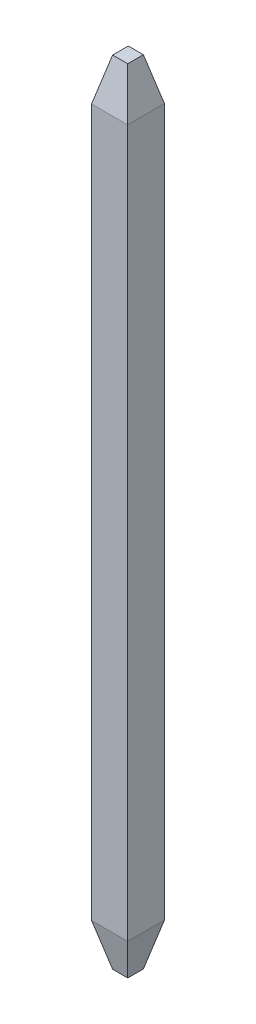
ISO-10303-21;
HEADER;
FILE_DESCRIPTION(('STEP AP214'),'2;1');
FILE_NAME('part.step','',(''),(''),'','','');
FILE_SCHEMA(('AUTOMOTIVE_DESIGN { 1 0 10303 214 1 1 1 1 }'));
ENDSEC;
DATA;
#1=APPLICATION_CONTEXT('core data for automotive mechanical design processes');
#2=APPLICATION_PROTOCOL_DEFINITION('international standard','automotive_design',2000,#1);
#3=PRODUCT_CONTEXT('',#1,'mechanical');
#4=PRODUCT('Part','Part','',(#3));
#5=PRODUCT_RELATED_PRODUCT_CATEGORY('part','',(#4));
#6=PRODUCT_DEFINITION_FORMATION('','',#4);
#7=PRODUCT_DEFINITION_CONTEXT('part definition',#1,'design');
#8=PRODUCT_DEFINITION('design','',#6,#7);
#9=PRODUCT_DEFINITION_SHAPE('','',#8);
#10=(LENGTH_UNIT() NAMED_UNIT(*) SI_UNIT(.MILLI.,.METRE.));
#11=(NAMED_UNIT(*) PLANE_ANGLE_UNIT() SI_UNIT($,.RADIAN.));
#12=(NAMED_UNIT(*) SI_UNIT($,.STERADIAN.) SOLID_ANGLE_UNIT());
#13=UNCERTAINTY_MEASURE_WITH_UNIT(LENGTH_MEASURE(1.E-05),#10,'distance_accuracy_value','');
#14=(GEOMETRIC_REPRESENTATION_CONTEXT(3) GLOBAL_UNCERTAINTY_ASSIGNED_CONTEXT((#13)) GLOBAL_UNIT_ASSIGNED_CONTEXT((#10,
#11,#12)) REPRESENTATION_CONTEXT('',''));
#15=CARTESIAN_POINT('',(0.,0.,0.));
#16=DIRECTION('',(0.,0.,1.));
#17=DIRECTION('',(1.,0.,0.));
#18=AXIS2_PLACEMENT_3D('',#15,#16,#17);
#19=CARTESIAN_POINT('',(0.65,0.,0.));
#20=DIRECTION('',(0.,0.,-1.));
#21=DIRECTION('',(-1.,0.,0.));
#22=AXIS2_PLACEMENT_3D('',#19,#20,#21);
#23=PLANE('',#22);
#24=DIRECTION('',(0.,-1.,0.));
#25=VECTOR('',#24,1.);
#26=CARTESIAN_POINT('',(0.,0.,0.));
#27=LINE('',#26,#25);
#28=CARTESIAN_POINT('',(0.,13.46,0.));
#29=VERTEX_POINT('',#28);
#30=CARTESIAN_POINT('',(0.,0.760000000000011,0.));
#31=VERTEX_POINT('',#30);
#32=EDGE_CURVE('E122',#29,#31,#27,.T.);
#33=ORIENTED_EDGE('',*,*,#32,.T.);
#34=DIRECTION('',(1.,0.,0.));
#35=VECTOR('',#34,1.);
#36=CARTESIAN_POINT('',(0.65,0.760000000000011,0.));
#37=LINE('',#36,#35);
#38=CARTESIAN_POINT('',(0.65,0.760000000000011,0.));
#39=VERTEX_POINT('',#38);
#40=EDGE_CURVE('E142',#31,#39,#37,.T.);
#41=ORIENTED_EDGE('',*,*,#40,.T.);
#42=DIRECTION('',(0.,-1.,0.));
#43=VECTOR('',#42,1.);
#44=CARTESIAN_POINT('',(0.65,0.,0.));
#45=LINE('',#44,#43);
#46=CARTESIAN_POINT('',(0.65,13.46,0.));
#47=VERTEX_POINT('',#46);
#48=EDGE_CURVE('E133',#47,#39,#45,.T.);
#49=ORIENTED_EDGE('',*,*,#48,.F.);
#50=DIRECTION('',(-1.,0.,0.));
#51=VECTOR('',#50,1.);
#52=CARTESIAN_POINT('',(0.65,13.46,0.));
#53=LINE('',#52,#51);
#54=EDGE_CURVE('E140',#47,#29,#53,.T.);
#55=ORIENTED_EDGE('',*,*,#54,.T.);
#56=EDGE_LOOP('',(#33,#41,#49,#55));
#57=FACE_BOUND('',#56,.T.);
#58=ADVANCED_FACE('F30',(#57),#23,.F.);
#59=CARTESIAN_POINT('',(0.65,0.,0.));
#60=DIRECTION('',(0.,1.,0.));
#61=DIRECTION('',(0.,0.,1.));
#62=AXIS2_PLACEMENT_3D('',#59,#60,#61);
#63=PLANE('',#62);
#64=DIRECTION('',(0.,0.,1.));
#65=VECTOR('',#64,1.);
#66=CARTESIAN_POINT('',(0.460510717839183,0.,0.));
#67=LINE('',#66,#65);
#68=CARTESIAN_POINT('',(0.460510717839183,0.,-0.470510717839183));
#69=VERTEX_POINT('',#68);
#70=CARTESIAN_POINT('',(0.460510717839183,0.,-0.189489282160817));
#71=VERTEX_POINT('',#70);
#72=EDGE_CURVE('E105',#69,#71,#67,.T.);
#73=ORIENTED_EDGE('',*,*,#72,.T.);
#74=DIRECTION('',(-1.,0.,0.));
#75=VECTOR('',#74,1.);
#76=CARTESIAN_POINT('',(0.65,0.,-0.189489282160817));
#77=LINE('',#76,#75);
#78=CARTESIAN_POINT('',(0.189489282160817,0.,-0.189489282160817));
#79=VERTEX_POINT('',#78);
#80=EDGE_CURVE('E101',#71,#79,#77,.T.);
#81=ORIENTED_EDGE('',*,*,#80,.T.);
#82=DIRECTION('',(0.,0.,-1.));
#83=VECTOR('',#82,1.);
#84=CARTESIAN_POINT('',(0.189489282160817,0.,-0.66));
#85=LINE('',#84,#83);
#86=CARTESIAN_POINT('',(0.189489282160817,0.,-0.470510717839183));
#87=VERTEX_POINT('',#86);
#88=EDGE_CURVE('E95',#79,#87,#85,.T.);
#89=ORIENTED_EDGE('',*,*,#88,.T.);
#90=DIRECTION('',(1.,0.,0.));
#91=VECTOR('',#90,1.);
#92=CARTESIAN_POINT('',(0.65,0.,-0.470510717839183));
#93=LINE('',#92,#91);
#94=EDGE_CURVE('E98',#87,#69,#93,.T.);
#95=ORIENTED_EDGE('',*,*,#94,.T.);
#96=EDGE_LOOP('',(#73,#81,#89,#95));
#97=FACE_BOUND('',#96,.T.);
#98=ADVANCED_FACE('F97',(#97),#63,.F.);
#99=CARTESIAN_POINT('',(0.65,0.,-0.66));
#100=DIRECTION('',(0.,0.,1.));
#101=DIRECTION('',(1.,0.,0.));
#102=AXIS2_PLACEMENT_3D('',#99,#100,#101);
#103=PLANE('',#102);
#104=DIRECTION('',(0.,1.,0.));
#105=VECTOR('',#104,1.);
#106=CARTESIAN_POINT('',(0.65,0.,-0.66));
#107=LINE('',#106,#105);
#108=CARTESIAN_POINT('',(0.65,0.760000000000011,-0.66));
#109=VERTEX_POINT('',#108);
#110=CARTESIAN_POINT('',(0.65,13.46,-0.66));
#111=VERTEX_POINT('',#110);
#112=EDGE_CURVE('E116',#109,#111,#107,.T.);
#113=ORIENTED_EDGE('',*,*,#112,.F.);
#114=DIRECTION('',(-1.,0.,0.));
#115=VECTOR('',#114,1.);
#116=CARTESIAN_POINT('',(0.65,0.760000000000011,-0.66));
#117=LINE('',#116,#115);
#118=CARTESIAN_POINT('',(0.,0.760000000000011,-0.66));
#119=VERTEX_POINT('',#118);
#120=EDGE_CURVE('E155',#109,#119,#117,.T.);
#121=ORIENTED_EDGE('',*,*,#120,.T.);
#122=DIRECTION('',(0.,1.,0.));
#123=VECTOR('',#122,1.);
#124=CARTESIAN_POINT('',(0.,0.,-0.66));
#125=LINE('',#124,#123);
#126=CARTESIAN_POINT('',(0.,13.46,-0.66));
#127=VERTEX_POINT('',#126);
#128=EDGE_CURVE('E130',#119,#127,#125,.T.);
#129=ORIENTED_EDGE('',*,*,#128,.T.);
#130=DIRECTION('',(1.,0.,0.));
#131=VECTOR('',#130,1.);
#132=CARTESIAN_POINT('',(0.65,13.46,-0.66));
#133=LINE('',#132,#131);
#134=EDGE_CURVE('E153',#127,#111,#133,.T.);
#135=ORIENTED_EDGE('',*,*,#134,.T.);
#136=EDGE_LOOP('',(#113,#121,#129,#135));
#137=FACE_BOUND('',#136,.T.);
#138=ADVANCED_FACE('F204',(#137),#103,.F.);
#139=CARTESIAN_POINT('',(0.65,14.22,0.));
#140=DIRECTION('',(0.,-1.,0.));
#141=DIRECTION('',(0.,0.,-1.));
#142=AXIS2_PLACEMENT_3D('',#139,#140,#141);
#143=PLANE('',#142);
#144=DIRECTION('',(-1.,0.,0.));
#145=VECTOR('',#144,1.);
#146=CARTESIAN_POINT('',(0.65,14.22,-0.470510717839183));
#147=LINE('',#146,#145);
#148=CARTESIAN_POINT('',(0.460510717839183,14.22,-0.470510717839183));
#149=VERTEX_POINT('',#148);
#150=CARTESIAN_POINT('',(0.189489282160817,14.22,-0.470510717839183));
#151=VERTEX_POINT('',#150);
#152=EDGE_CURVE('E37',#149,#151,#147,.T.);
#153=ORIENTED_EDGE('',*,*,#152,.T.);
#154=DIRECTION('',(0.,0.,1.));
#155=VECTOR('',#154,1.);
#156=CARTESIAN_POINT('',(0.189489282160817,14.22,0.));
#157=LINE('',#156,#155);
#158=CARTESIAN_POINT('',(0.189489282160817,14.22,-0.189489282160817));
#159=VERTEX_POINT('',#158);
#160=EDGE_CURVE('E11',#151,#159,#157,.T.);
#161=ORIENTED_EDGE('',*,*,#160,.T.);
#162=DIRECTION('',(1.,0.,0.));
#163=VECTOR('',#162,1.);
#164=CARTESIAN_POINT('',(0.65,14.22,-0.189489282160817));
#165=LINE('',#164,#163);
#166=CARTESIAN_POINT('',(0.460510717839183,14.22,-0.189489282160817));
#167=VERTEX_POINT('',#166);
#168=EDGE_CURVE('E159',#159,#167,#165,.T.);
#169=ORIENTED_EDGE('',*,*,#168,.T.);
#170=DIRECTION('',(0.,0.,-1.));
#171=VECTOR('',#170,1.);
#172=CARTESIAN_POINT('',(0.460510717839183,14.22,0.));
#173=LINE('',#172,#171);
#174=EDGE_CURVE('E157',#167,#149,#173,.T.);
#175=ORIENTED_EDGE('',*,*,#174,.T.);
#176=EDGE_LOOP('',(#153,#161,#169,#175));
#177=FACE_BOUND('',#176,.T.);
#178=ADVANCED_FACE('F161',(#177),#143,.F.);
#179=CARTESIAN_POINT('',(0.65,14.22,0.));
#180=DIRECTION('',(-1.,0.,0.));
#181=DIRECTION('',(0.,0.,1.));
#182=AXIS2_PLACEMENT_3D('',#179,#180,#181);
#183=PLANE('',#182);
#184=ORIENTED_EDGE('',*,*,#48,.T.);
#185=DIRECTION('',(0.,0.,-1.));
#186=VECTOR('',#185,1.);
#187=CARTESIAN_POINT('',(0.65,0.760000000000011,0.));
#188=LINE('',#187,#186);
#189=EDGE_CURVE('E147',#39,#109,#188,.T.);
#190=ORIENTED_EDGE('',*,*,#189,.T.);
#191=ORIENTED_EDGE('',*,*,#112,.T.);
#192=DIRECTION('',(0.,0.,1.));
#193=VECTOR('',#192,1.);
#194=CARTESIAN_POINT('',(0.65,13.46,0.));
#195=LINE('',#194,#193);
#196=EDGE_CURVE('E145',#111,#47,#195,.T.);
#197=ORIENTED_EDGE('',*,*,#196,.T.);
#198=EDGE_LOOP('',(#184,#190,#191,#197));
#199=FACE_BOUND('',#198,.T.);
#200=ADVANCED_FACE('F188',(#199),#183,.F.);
#201=CARTESIAN_POINT('',(0.,14.22,0.));
#202=DIRECTION('',(-1.,0.,0.));
#203=DIRECTION('',(0.,0.,1.));
#204=AXIS2_PLACEMENT_3D('',#201,#202,#203);
#205=PLANE('',#204);
#206=ORIENTED_EDGE('',*,*,#128,.F.);
#207=DIRECTION('',(0.,0.,1.));
#208=VECTOR('',#207,1.);
#209=CARTESIAN_POINT('',(0.,0.760000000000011,0.));
#210=LINE('',#209,#208);
#211=EDGE_CURVE('E119',#119,#31,#210,.T.);
#212=ORIENTED_EDGE('',*,*,#211,.T.);
#213=ORIENTED_EDGE('',*,*,#32,.F.);
#214=DIRECTION('',(0.,0.,-1.));
#215=VECTOR('',#214,1.);
#216=CARTESIAN_POINT('',(0.,13.46,-0.66));
#217=LINE('',#216,#215);
#218=EDGE_CURVE('E149',#29,#127,#217,.T.);
#219=ORIENTED_EDGE('',*,*,#218,.T.);
#220=EDGE_LOOP('',(#206,#212,#213,#219));
#221=FACE_BOUND('',#220,.T.);
#222=ADVANCED_FACE('F215',(#221),#205,.T.);
#223=CARTESIAN_POINT('',(0.65,0.760000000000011,-0.66));
#224=DIRECTION('',(0.,0.241921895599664,0.970295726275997));
#225=DIRECTION('',(0.,-0.970295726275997,0.241921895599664));
#226=AXIS2_PLACEMENT_3D('',#223,#224,#225);
#227=PLANE('',#226);
#228=DIRECTION('',(0.235138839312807,-0.943090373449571,0.235138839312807));
#229=VECTOR('',#228,1.);
#230=CARTESIAN_POINT('',(0.0359386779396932,0.615857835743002,-0.624061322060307));
#231=LINE('',#230,#229);
#232=EDGE_CURVE('E111',#119,#87,#231,.T.);
#233=ORIENTED_EDGE('',*,*,#232,.F.);
#234=ORIENTED_EDGE('',*,*,#120,.F.);
#235=DIRECTION('',(-0.235138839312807,-0.943090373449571,0.235138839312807));
#236=VECTOR('',#235,1.);
#237=CARTESIAN_POINT('',(0.65,0.760000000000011,-0.66));
#238=LINE('',#237,#236);
#239=EDGE_CURVE('E114',#69,#109,#238,.F.);
#240=ORIENTED_EDGE('',*,*,#239,.F.);
#241=ORIENTED_EDGE('',*,*,#94,.F.);
#242=EDGE_LOOP('',(#233,#234,#240,#241));
#243=FACE_BOUND('',#242,.T.);
#244=ADVANCED_FACE('F109',(#243),#227,.F.);
#245=CARTESIAN_POINT('',(0.65,0.760000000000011,0.));
#246=DIRECTION('',(-0.970295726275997,0.241921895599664,0.));
#247=DIRECTION('',(-0.241921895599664,-0.970295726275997,0.));
#248=AXIS2_PLACEMENT_3D('',#245,#246,#247);
#249=PLANE('',#248);
#250=ORIENTED_EDGE('',*,*,#239,.T.);
#251=ORIENTED_EDGE('',*,*,#189,.F.);
#252=DIRECTION('',(-0.235138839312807,-0.943090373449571,-0.235138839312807));
#253=VECTOR('',#252,1.);
#254=CARTESIAN_POINT('',(0.65,0.760000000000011,0.));
#255=LINE('',#254,#253);
#256=EDGE_CURVE('E120',#71,#39,#255,.F.);
#257=ORIENTED_EDGE('',*,*,#256,.F.);
#258=ORIENTED_EDGE('',*,*,#72,.F.);
#259=EDGE_LOOP('',(#250,#251,#257,#258));
#260=FACE_BOUND('',#259,.T.);
#261=ADVANCED_FACE('F221',(#260),#249,.F.);
#262=CARTESIAN_POINT('',(0.189489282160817,0.,0.));
#263=DIRECTION('',(-0.970295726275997,-0.241921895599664,0.));
#264=DIRECTION('',(0.241921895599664,-0.970295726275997,0.));
#265=AXIS2_PLACEMENT_3D('',#262,#263,#264);
#266=PLANE('',#265);
#267=ORIENTED_EDGE('',*,*,#232,.T.);
#268=ORIENTED_EDGE('',*,*,#88,.F.);
#269=DIRECTION('',(0.235138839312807,-0.943090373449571,-0.235138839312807));
#270=VECTOR('',#269,1.);
#271=CARTESIAN_POINT('',(0.179012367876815,0.042020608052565,-0.179012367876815));
#272=LINE('',#271,#270);
#273=EDGE_CURVE('E124',#31,#79,#272,.T.);
#274=ORIENTED_EDGE('',*,*,#273,.F.);
#275=ORIENTED_EDGE('',*,*,#211,.F.);
#276=EDGE_LOOP('',(#267,#268,#274,#275));
#277=FACE_BOUND('',#276,.T.);
#278=ADVANCED_FACE('F118',(#277),#266,.T.);
#279=CARTESIAN_POINT('',(0.65,0.,-0.189489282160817));
#280=DIRECTION('',(0.,0.241921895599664,-0.970295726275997));
#281=DIRECTION('',(0.,0.970295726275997,0.241921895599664));
#282=AXIS2_PLACEMENT_3D('',#279,#280,#281);
#283=PLANE('',#282);
#284=ORIENTED_EDGE('',*,*,#256,.T.);
#285=ORIENTED_EDGE('',*,*,#40,.F.);
#286=ORIENTED_EDGE('',*,*,#273,.T.);
#287=ORIENTED_EDGE('',*,*,#80,.F.);
#288=EDGE_LOOP('',(#284,#285,#286,#287));
#289=FACE_BOUND('',#288,.T.);
#290=ADVANCED_FACE('F181',(#289),#283,.F.);
#291=CARTESIAN_POINT('',(0.65,13.46,0.));
#292=DIRECTION('',(-0.970295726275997,-0.241921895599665,0.));
#293=DIRECTION('',(0.241921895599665,-0.970295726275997,0.));
#294=AXIS2_PLACEMENT_3D('',#291,#292,#293);
#295=PLANE('',#294);
#296=DIRECTION('',(0.235138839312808,-0.943090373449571,0.235138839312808));
#297=VECTOR('',#296,1.);
#298=CARTESIAN_POINT('',(0.65,13.46,0.));
#299=LINE('',#298,#297);
#300=EDGE_CURVE('E169',#47,#167,#299,.F.);
#301=ORIENTED_EDGE('',*,*,#300,.F.);
#302=ORIENTED_EDGE('',*,*,#196,.F.);
#303=DIRECTION('',(-0.235138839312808,0.943090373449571,0.235138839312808));
#304=VECTOR('',#303,1.);
#305=CARTESIAN_POINT('',(0.613508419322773,13.6063597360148,-0.623508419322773));
#306=LINE('',#305,#304);
#307=EDGE_CURVE('E172',#149,#111,#306,.F.);
#308=ORIENTED_EDGE('',*,*,#307,.F.);
#309=ORIENTED_EDGE('',*,*,#174,.F.);
#310=EDGE_LOOP('',(#301,#302,#308,#309));
#311=FACE_BOUND('',#310,.T.);
#312=ADVANCED_FACE('F167',(#311),#295,.F.);
#313=CARTESIAN_POINT('',(0.65,14.22,-0.470510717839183));
#314=DIRECTION('',(0.,-0.241921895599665,0.970295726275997));
#315=DIRECTION('',(0.,-0.970295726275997,-0.241921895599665));
#316=AXIS2_PLACEMENT_3D('',#313,#314,#315);
#317=PLANE('',#316);
#318=ORIENTED_EDGE('',*,*,#307,.T.);
#319=ORIENTED_EDGE('',*,*,#134,.F.);
#320=DIRECTION('',(-0.235138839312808,-0.943090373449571,-0.235138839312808));
#321=VECTOR('',#320,1.);
#322=CARTESIAN_POINT('',(0.214951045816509,14.3221215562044,-0.445048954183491));
#323=LINE('',#322,#321);
#324=EDGE_CURVE('E174',#151,#127,#323,.T.);
#325=ORIENTED_EDGE('',*,*,#324,.F.);
#326=ORIENTED_EDGE('',*,*,#152,.F.);
#327=EDGE_LOOP('',(#318,#319,#325,#326));
#328=FACE_BOUND('',#327,.T.);
#329=ADVANCED_FACE('F192',(#328),#317,.F.);
#330=CARTESIAN_POINT('',(0.65,13.46,0.));
#331=DIRECTION('',(0.,-0.241921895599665,-0.970295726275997));
#332=DIRECTION('',(0.,0.970295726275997,-0.241921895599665));
#333=AXIS2_PLACEMENT_3D('',#330,#331,#332);
#334=PLANE('',#333);
#335=ORIENTED_EDGE('',*,*,#300,.T.);
#336=ORIENTED_EDGE('',*,*,#168,.F.);
#337=DIRECTION('',(0.235138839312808,0.943090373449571,-0.235138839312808));
#338=VECTOR('',#337,1.);
#339=CARTESIAN_POINT('',(0.0359386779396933,13.604142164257,-0.0359386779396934));
#340=LINE('',#339,#338);
#341=EDGE_CURVE('E50',#29,#159,#340,.T.);
#342=ORIENTED_EDGE('',*,*,#341,.F.);
#343=ORIENTED_EDGE('',*,*,#54,.F.);
#344=EDGE_LOOP('',(#335,#336,#342,#343));
#345=FACE_BOUND('',#344,.T.);
#346=ADVANCED_FACE('F173',(#345),#334,.F.);
#347=CARTESIAN_POINT('',(0.189489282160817,14.22,0.));
#348=DIRECTION('',(-0.970295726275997,0.241921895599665,0.));
#349=DIRECTION('',(-0.241921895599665,-0.970295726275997,0.));
#350=AXIS2_PLACEMENT_3D('',#347,#348,#349);
#351=PLANE('',#350);
#352=ORIENTED_EDGE('',*,*,#324,.T.);
#353=ORIENTED_EDGE('',*,*,#218,.F.);
#354=ORIENTED_EDGE('',*,*,#341,.T.);
#355=ORIENTED_EDGE('',*,*,#160,.F.);
#356=EDGE_LOOP('',(#352,#353,#354,#355));
#357=FACE_BOUND('',#356,.T.);
#358=ADVANCED_FACE('F193',(#357),#351,.T.);
#359=CLOSED_SHELL('',(#58,#98,#138,#178,#200,#222,#244,#261,#278,#290,#312,#329,#346,#358));
#360=MANIFOLD_SOLID_BREP('B2',#359);
#361=ADVANCED_BREP_SHAPE_REPRESENTATION('',(#18,#360),#14);
#362=SHAPE_DEFINITION_REPRESENTATION(#9,#361);
ENDSEC;
END-ISO-10303-21;
